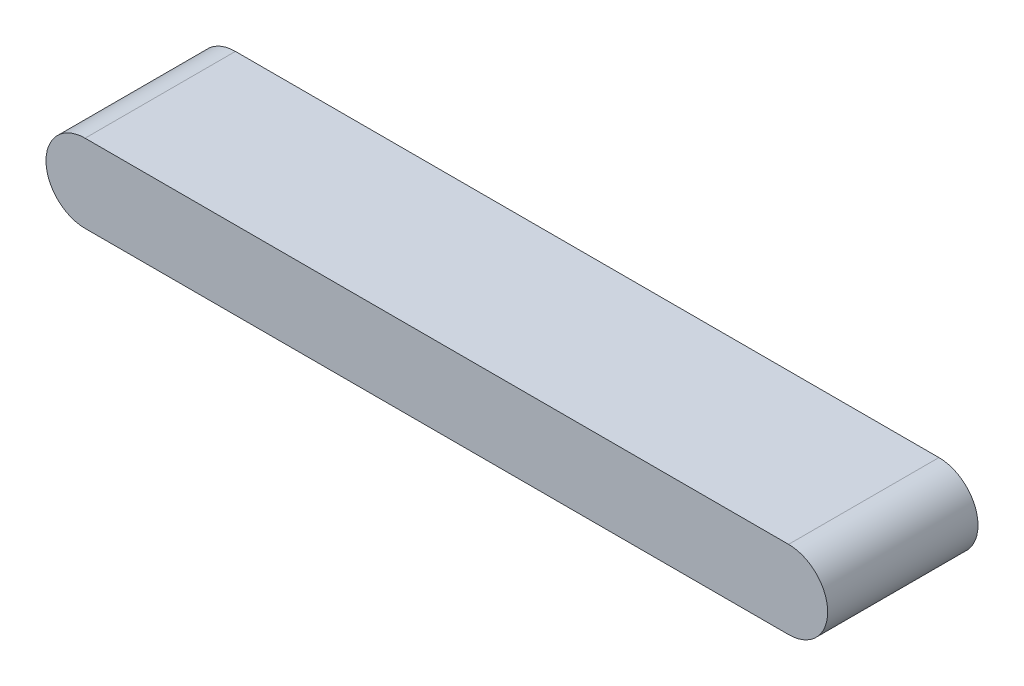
ISO-10303-21;
HEADER;
FILE_DESCRIPTION(('STEP AP214'),'2;1');
FILE_NAME('part.step','',(''),(''),'','','');
FILE_SCHEMA(('AUTOMOTIVE_DESIGN { 1 0 10303 214 1 1 1 1 }'));
ENDSEC;
DATA;
#1=APPLICATION_CONTEXT('core data for automotive mechanical design processes');
#2=APPLICATION_PROTOCOL_DEFINITION('international standard','automotive_design',2000,#1);
#3=PRODUCT_CONTEXT('',#1,'mechanical');
#4=PRODUCT('Part','Part','',(#3));
#5=PRODUCT_RELATED_PRODUCT_CATEGORY('part','',(#4));
#6=PRODUCT_DEFINITION_FORMATION('','',#4);
#7=PRODUCT_DEFINITION_CONTEXT('part definition',#1,'design');
#8=PRODUCT_DEFINITION('design','',#6,#7);
#9=PRODUCT_DEFINITION_SHAPE('','',#8);
#10=(LENGTH_UNIT() NAMED_UNIT(*) SI_UNIT(.MILLI.,.METRE.));
#11=(NAMED_UNIT(*) PLANE_ANGLE_UNIT() SI_UNIT($,.RADIAN.));
#12=(NAMED_UNIT(*) SI_UNIT($,.STERADIAN.) SOLID_ANGLE_UNIT());
#13=UNCERTAINTY_MEASURE_WITH_UNIT(LENGTH_MEASURE(1.E-05),#10,'distance_accuracy_value','');
#14=(GEOMETRIC_REPRESENTATION_CONTEXT(3) GLOBAL_UNCERTAINTY_ASSIGNED_CONTEXT((#13)) GLOBAL_UNIT_ASSIGNED_CONTEXT((#10,
#11,#12)) REPRESENTATION_CONTEXT('',''));
#15=CARTESIAN_POINT('',(0.,0.,0.));
#16=DIRECTION('',(0.,0.,1.));
#17=DIRECTION('',(1.,0.,0.));
#18=AXIS2_PLACEMENT_3D('',#15,#16,#17);
#19=CARTESIAN_POINT('',(0.,0.,63.5));
#20=DIRECTION('',(0.,0.,-1.));
#21=DIRECTION('',(-1.,0.,0.));
#22=AXIS2_PLACEMENT_3D('',#19,#20,#21);
#23=CYLINDRICAL_SURFACE('',#22,16.51);
#24=CARTESIAN_POINT('',(0.,0.,0.));
#25=DIRECTION('',(0.,0.,1.));
#26=DIRECTION('',(1.,0.,0.));
#27=AXIS2_PLACEMENT_3D('',#24,#25,#26);
#28=CIRCLE('',#27,16.51);
#29=CARTESIAN_POINT('',(0.,16.51,0.));
#30=VERTEX_POINT('',#29);
#31=CARTESIAN_POINT('',(0.,-16.51,0.));
#32=VERTEX_POINT('',#31);
#33=EDGE_CURVE('E97',#30,#32,#28,.T.);
#34=ORIENTED_EDGE('',*,*,#33,.T.);
#35=DIRECTION('',(0.,0.,-1.));
#36=VECTOR('',#35,1.);
#37=CARTESIAN_POINT('',(0.,-16.51,63.5));
#38=LINE('',#37,#36);
#39=CARTESIAN_POINT('',(0.,-16.51,63.5));
#40=VERTEX_POINT('',#39);
#41=EDGE_CURVE('E11',#40,#32,#38,.T.);
#42=ORIENTED_EDGE('',*,*,#41,.F.);
#43=CARTESIAN_POINT('',(0.,0.,63.5));
#44=DIRECTION('',(0.,0.,1.));
#45=DIRECTION('',(1.,0.,0.));
#46=AXIS2_PLACEMENT_3D('',#43,#44,#45);
#47=CIRCLE('',#46,16.51);
#48=CARTESIAN_POINT('',(0.,16.51,63.5));
#49=VERTEX_POINT('',#48);
#50=EDGE_CURVE('E85',#49,#40,#47,.T.);
#51=ORIENTED_EDGE('',*,*,#50,.F.);
#52=DIRECTION('',(0.,0.,-1.));
#53=VECTOR('',#52,1.);
#54=CARTESIAN_POINT('',(0.,16.51,63.5));
#55=LINE('',#54,#53);
#56=EDGE_CURVE('E93',#49,#30,#55,.T.);
#57=ORIENTED_EDGE('',*,*,#56,.T.);
#58=EDGE_LOOP('',(#34,#42,#51,#57));
#59=FACE_BOUND('',#58,.T.);
#60=ADVANCED_FACE('F34',(#59),#23,.T.);
#61=CARTESIAN_POINT('',(0.,-16.51,63.5));
#62=DIRECTION('',(0.,1.,0.));
#63=DIRECTION('',(0.,0.,1.));
#64=AXIS2_PLACEMENT_3D('',#61,#62,#63);
#65=PLANE('',#64);
#66=DIRECTION('',(1.,0.,0.));
#67=VECTOR('',#66,1.);
#68=CARTESIAN_POINT('',(0.,-16.51,0.));
#69=LINE('',#68,#67);
#70=CARTESIAN_POINT('',(297.18,-16.51,0.));
#71=VERTEX_POINT('',#70);
#72=EDGE_CURVE('E89',#32,#71,#69,.T.);
#73=ORIENTED_EDGE('',*,*,#72,.T.);
#74=DIRECTION('',(0.,0.,-1.));
#75=VECTOR('',#74,1.);
#76=CARTESIAN_POINT('',(297.18,-16.51,63.5));
#77=LINE('',#76,#75);
#78=CARTESIAN_POINT('',(297.18,-16.51,63.5));
#79=VERTEX_POINT('',#78);
#80=EDGE_CURVE('E42',#79,#71,#77,.T.);
#81=ORIENTED_EDGE('',*,*,#80,.F.);
#82=DIRECTION('',(1.,0.,0.));
#83=VECTOR('',#82,1.);
#84=CARTESIAN_POINT('',(0.,-16.51,63.5));
#85=LINE('',#84,#83);
#86=EDGE_CURVE('E80',#40,#79,#85,.T.);
#87=ORIENTED_EDGE('',*,*,#86,.F.);
#88=ORIENTED_EDGE('',*,*,#41,.T.);
#89=EDGE_LOOP('',(#73,#81,#87,#88));
#90=FACE_BOUND('',#89,.T.);
#91=ADVANCED_FACE('F88',(#90),#65,.F.);
#92=CARTESIAN_POINT('',(297.18,0.,63.5));
#93=DIRECTION('',(0.,0.,-1.));
#94=DIRECTION('',(-1.,0.,0.));
#95=AXIS2_PLACEMENT_3D('',#92,#93,#94);
#96=CYLINDRICAL_SURFACE('',#95,16.51);
#97=CARTESIAN_POINT('',(297.18,0.,0.));
#98=DIRECTION('',(0.,0.,1.));
#99=DIRECTION('',(1.,0.,0.));
#100=AXIS2_PLACEMENT_3D('',#97,#98,#99);
#101=CIRCLE('',#100,16.51);
#102=CARTESIAN_POINT('',(297.18,16.51,0.));
#103=VERTEX_POINT('',#102);
#104=EDGE_CURVE('E67',#71,#103,#101,.T.);
#105=ORIENTED_EDGE('',*,*,#104,.T.);
#106=DIRECTION('',(0.,0.,-1.));
#107=VECTOR('',#106,1.);
#108=CARTESIAN_POINT('',(297.18,16.51,63.5));
#109=LINE('',#108,#107);
#110=CARTESIAN_POINT('',(297.18,16.51,63.5));
#111=VERTEX_POINT('',#110);
#112=EDGE_CURVE('E90',#111,#103,#109,.T.);
#113=ORIENTED_EDGE('',*,*,#112,.F.);
#114=CARTESIAN_POINT('',(297.18,0.,63.5));
#115=DIRECTION('',(0.,0.,1.));
#116=DIRECTION('',(1.,0.,0.));
#117=AXIS2_PLACEMENT_3D('',#114,#115,#116);
#118=CIRCLE('',#117,16.51);
#119=EDGE_CURVE('E83',#79,#111,#118,.T.);
#120=ORIENTED_EDGE('',*,*,#119,.F.);
#121=ORIENTED_EDGE('',*,*,#80,.T.);
#122=EDGE_LOOP('',(#105,#113,#120,#121));
#123=FACE_BOUND('',#122,.T.);
#124=ADVANCED_FACE('F91',(#123),#96,.T.);
#125=CARTESIAN_POINT('',(0.,16.51,63.5));
#126=DIRECTION('',(0.,-1.,0.));
#127=DIRECTION('',(0.,0.,-1.));
#128=AXIS2_PLACEMENT_3D('',#125,#126,#127);
#129=PLANE('',#128);
#130=DIRECTION('',(-1.,0.,0.));
#131=VECTOR('',#130,1.);
#132=CARTESIAN_POINT('',(0.,16.51,0.));
#133=LINE('',#132,#131);
#134=EDGE_CURVE('E73',#103,#30,#133,.T.);
#135=ORIENTED_EDGE('',*,*,#134,.T.);
#136=ORIENTED_EDGE('',*,*,#56,.F.);
#137=DIRECTION('',(-1.,0.,0.));
#138=VECTOR('',#137,1.);
#139=CARTESIAN_POINT('',(0.,16.51,63.5));
#140=LINE('',#139,#138);
#141=EDGE_CURVE('E50',#111,#49,#140,.T.);
#142=ORIENTED_EDGE('',*,*,#141,.F.);
#143=ORIENTED_EDGE('',*,*,#112,.T.);
#144=EDGE_LOOP('',(#135,#136,#142,#143));
#145=FACE_BOUND('',#144,.T.);
#146=ADVANCED_FACE('F104',(#145),#129,.F.);
#147=CARTESIAN_POINT('',(0.,0.,63.5));
#148=DIRECTION('',(0.,0.,1.));
#149=DIRECTION('',(1.,0.,0.));
#150=AXIS2_PLACEMENT_3D('',#147,#148,#149);
#151=PLANE('',#150);
#152=ORIENTED_EDGE('',*,*,#50,.T.);
#153=ORIENTED_EDGE('',*,*,#86,.T.);
#154=ORIENTED_EDGE('',*,*,#119,.T.);
#155=ORIENTED_EDGE('',*,*,#141,.T.);
#156=EDGE_LOOP('',(#152,#153,#154,#155));
#157=FACE_BOUND('',#156,.T.);
#158=ADVANCED_FACE('F81',(#157),#151,.T.);
#159=CARTESIAN_POINT('',(0.,0.,0.));
#160=DIRECTION('',(0.,0.,1.));
#161=DIRECTION('',(1.,0.,0.));
#162=AXIS2_PLACEMENT_3D('',#159,#160,#161);
#163=PLANE('',#162);
#164=ORIENTED_EDGE('',*,*,#33,.F.);
#165=ORIENTED_EDGE('',*,*,#134,.F.);
#166=ORIENTED_EDGE('',*,*,#104,.F.);
#167=ORIENTED_EDGE('',*,*,#72,.F.);
#168=EDGE_LOOP('',(#164,#165,#166,#167));
#169=FACE_BOUND('',#168,.T.);
#170=ADVANCED_FACE('F107',(#169),#163,.F.);
#171=CLOSED_SHELL('',(#60,#91,#124,#146,#158,#170));
#172=MANIFOLD_SOLID_BREP('B2',#171);
#173=ADVANCED_BREP_SHAPE_REPRESENTATION('',(#18,#172),#14);
#174=SHAPE_DEFINITION_REPRESENTATION(#9,#173);
ENDSEC;
END-ISO-10303-21;
